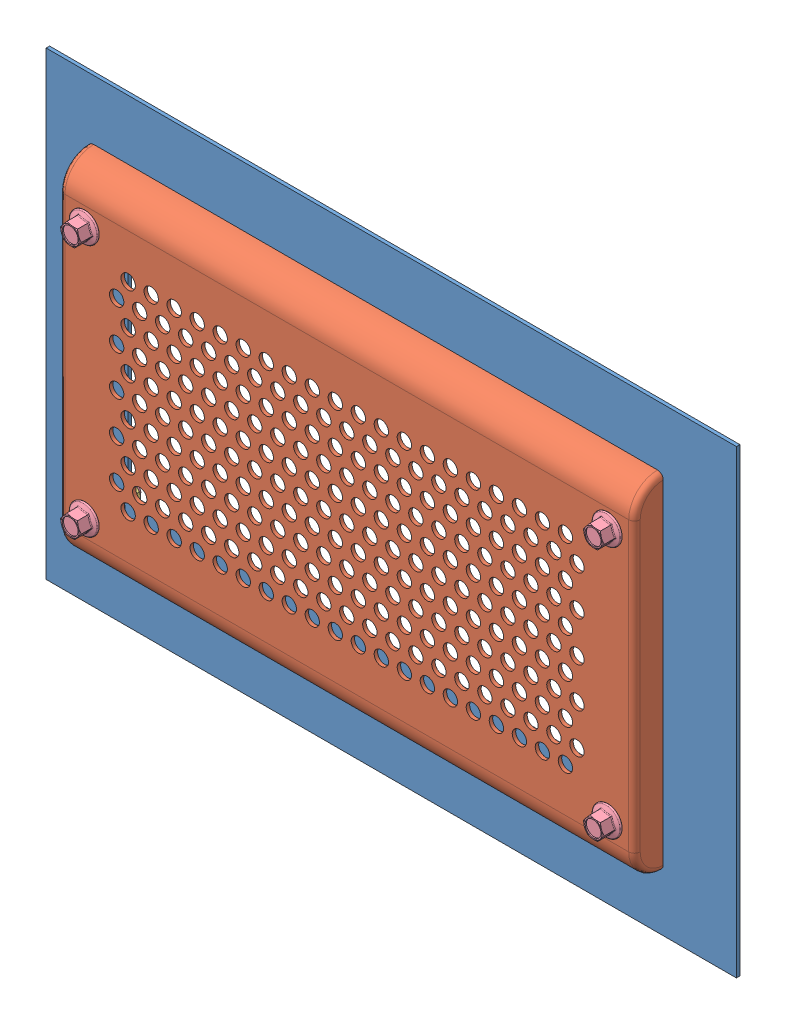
SolidWorks assembly temp cover assy.SLDASM, configuration Default (file format 4052). Lengths in mm.
Overall size (304.8 203.2 28.7).
10 component instances, 4 part files, 11 mates.
Components (placement in the parent):
- reference plate-1: reference plate.SLDPRT [Default] at (-73.3686 49.1354 -0.7601) size (304.8 203.2 1.52)
- cover-1: cover.SLDPRT [Default] at (-87.5274 50.7253 0.7639) size (254 152.4 12.7)
- nut-2: nut.SLDPRT [6mm diameter] at (108.3109 -56.5805 -5.9601) x (-0.923728 -0.383049 0) z (0 0 -1) size (10 11.55 5.2)
- nut-3: nut.SLDPRT [6mm diameter] at (108.3109 54.9329 -0.7601) x (0.504057 0.863671 0) z (0 0 1) size (10 11.55 5.2)
- nut-4: nut.SLDPRT [6mm diameter] at (-122.573 -56.5805 -5.9601) x (0.999784 0.020804 0) z (0 0 -1) size (10 11.55 5.2)
- nut-5: nut.SLDPRT [6mm diameter] at (-122.573 54.9329 -0.7601) x (0.556996 -0.830515 0) z (0 0 1) size (10 11.55 5.2)
- screw-1: screw.sldprt [6mm diameter] at (108.3109 54.9329 20.1639) x (0 0 -1) z (0.935662 0.352897 0) size (28.7 12.8 12.8)
- screw-2: screw.sldprt [6mm diameter] at (-122.573 54.9329 20.1639) x (0 0 -1) z (0.935662 0.352897 0) size (28.7 12.8 12.8)
- screw-3: screw.sldprt [6mm diameter] at (-122.573 -56.5805 20.1639) x (0 0 -1) z (0.935662 0.352897 0) size (28.7 12.8 12.8)
- screw-4: screw.sldprt [6mm diameter] at (108.3109 -56.5805 20.1639) x (0 0 -1) z (0.935662 0.352897 0) size (28.7 12.8 12.8)
Mates (geometry in assembly coordinates):
- Coincident1: coincident anti-aligned: plane of reference plate-1 through (-152.5949 -101.4515 0.7639) normal (0 0 1); plane of cover-1 through (-134.1311 -77.0238 0.7639) normal (0 0 -1)
- Concentric1: concentric aligned: cylinder of reference plate-1 through (108.3109 -56.5805 0.7639) axis (0 0 -1) radius 2.2479; cylinder of nut-2 through (108.3109 -56.5805 19.0774) axis (0 0 -1) radius 3
- Coincident2: coincident anti-aligned: plane of reference plate-1 through (-152.5949 -101.4515 -0.7601) normal (0 0 -1); plane of nut-2 through (106.0994 -51.2474 -0.7601) normal (0 0 1)
- Concentric2: concentric anti-aligned: circle of reference plate-1; circle of nut-5
- Coincident3: coincident anti-aligned: plane of reference plate-1 through (-152.5949 -101.4515 -0.7601) normal (0 0 -1); plane of nut-5 through (-117.7781 58.1488 -0.7601) normal (0 0 1)
- Concentric3: concentric aligned: cylinder of reference plate-1 through (-122.573 -56.5805 0.7639) axis (0 0 -1) radius 2.2479; cylinder of nut-4 through (-122.573 -56.5805 19.0774) axis (0 0 -1) radius 3
- Coincident4: coincident anti-aligned: plane of reference plate-1 through (-152.5949 -101.4515 -0.7601) normal (0 0 -1); plane of nut-4 through (-122.4529 -62.3528 -0.7601) normal (0 0 1)
- Coincident5: coincident anti-aligned: plane of reference plate-1 through (-152.5949 -101.4515 -0.7601) normal (0 0 -1); plane of nut-3 through (103.3245 57.8431 -0.7601) normal (0 0 1)
- Concentric4: concentric anti-aligned: circle of reference plate-1; cylinder of nut-3 through (108.3109 54.9329 -5.9601) axis (0 0 1) radius 2.5
- Concentric5: concentric aligned: cylinder of cover-1 through (108.3109 54.9329 13.4639) axis (0 0 1) radius 3.3; cylinder of screw-1 through (108.3109 54.9329 45.5639) axis (0 0 1) radius 2.5
- Coincident6: coincident anti-aligned: plane of cover-1 through (-134.1311 -77.0238 13.4639) normal (0 0 1); plane of screw-1 through (107.4286 57.2721 13.4639) normal (0 0 -1)
